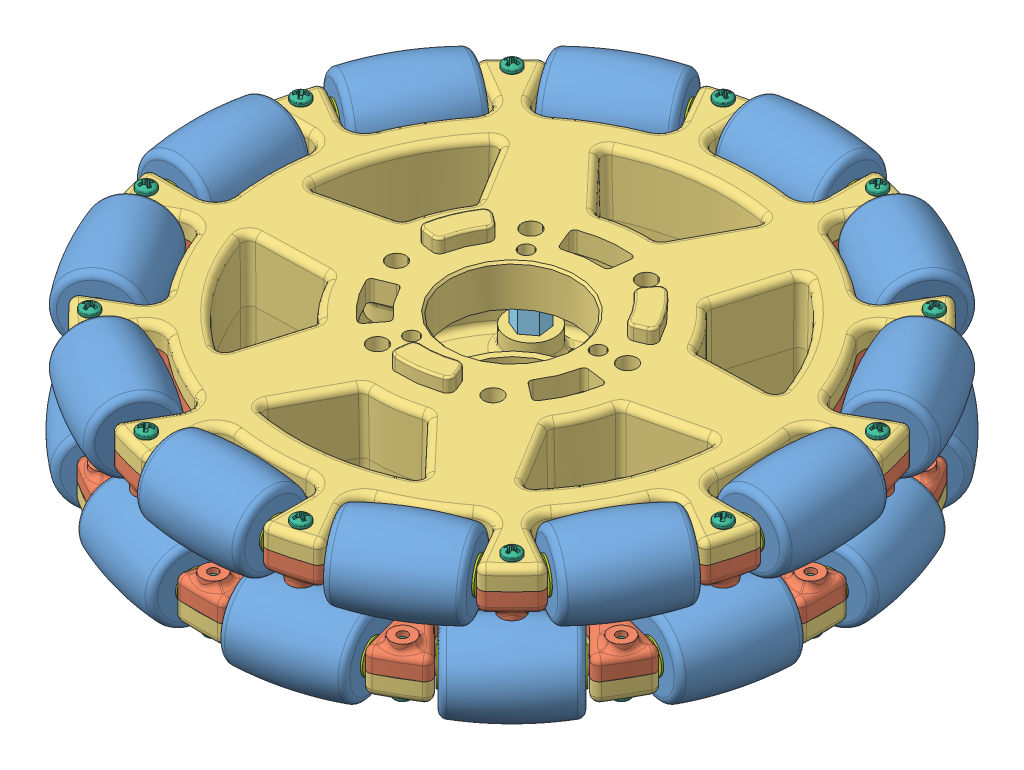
SolidWorks assembly 2_6 inch omni wheel.SLDASM, configuration Default (file format 7000). Lengths in mm.
Overall size (174.23 42.44 174.23).
129 component instances, 7 part files, 0 mates.
Components (placement in the parent):
- 2_217-2585-001 Rev1-1: 2_217-2585-001 Rev1.sldprt [Default] at (0 9.4629 -66.8297) x (1 0 0) z (0 -0.857126 0.515108) size (24.13 18.81 18.81)
- 2_217-2585-002 Rev1-1: 2_217-2585-002 Rev1.sldprt [Default] x (1 0 0) z (0 1 0) size (145.16 145.16 19.05)
- 2_217-2585-001 Rev1-2: 2_217-2585-001 Rev1.sldprt [Default] at (47.2557 -9.4629 47.2557) x (-0.707107 0 0.707107) z (-0.700403 -0.137373 -0.700403) size (24.13 18.81 18.81)
- 2_217-2585-001 Rev1-3: 2_217-2585-001 Rev1.sldprt [Default] at (17.2968 -9.4629 64.5525) x (-0.965926 0 0.258819) z (-0.256365 -0.137373 -0.956768) size (24.13 18.81 18.81)
- 2_217-2585-001 Rev1-4: 2_217-2585-001 Rev1.sldprt [Default] at (-17.2968 -9.4629 64.5525) x (-0.965926 0 -0.258819) z (0.256365 -0.137373 -0.956768) size (24.13 18.81 18.81)
- 2_217-2585-001 Rev1-5: 2_217-2585-001 Rev1.sldprt [Default] at (-47.2557 -9.4629 47.2557) x (-0.707107 0 -0.707107) z (0.700403 -0.137373 -0.700403) size (24.13 18.81 18.81)
- 2_217-2585-001 Rev1-6: 2_217-2585-001 Rev1.sldprt [Default] at (-64.5525 -9.4629 17.2968) x (-0.258819 0 -0.965926) z (0.956768 -0.137373 -0.256365) size (24.13 18.81 18.81)
- 2_217-2585-001 Rev1-7: 2_217-2585-001 Rev1.sldprt [Default] at (-64.5525 -9.4629 -17.2968) x (0.258819 0 -0.965926) z (0.956768 -0.137373 0.256365) size (24.13 18.81 18.81)
- 2_217-2585-001 Rev1-8: 2_217-2585-001 Rev1.sldprt [Default] at (-47.2557 -9.4629 -47.2557) x (0.707107 0 -0.707107) z (0.700403 -0.137373 0.700403) size (24.13 18.81 18.81)
- 2_217-2585-001 Rev1-9: 2_217-2585-001 Rev1.sldprt [Default] at (-17.2968 -9.4629 -64.5525) x (0.965926 0 -0.258819) z (0.256365 -0.137373 0.956768) size (24.13 18.81 18.81)
- 2_217-2585-001 Rev1-10: 2_217-2585-001 Rev1.sldprt [Default] at (17.2968 -9.4629 -64.5525) x (0.965926 0 0.258819) z (-0.256365 -0.137373 0.956768) size (24.13 18.81 18.81)
- 2_217-2585-001 Rev1-11: 2_217-2585-001 Rev1.sldprt [Default] at (47.2557 -9.4629 -47.2557) x (0.707107 0 0.707107) z (-0.700403 -0.137373 0.700403) size (24.13 18.81 18.81)
- 2_217-2585-001 Rev1-12: 2_217-2585-001 Rev1.sldprt [Default] at (64.5525 -9.4629 -17.2968) x (0.258819 0 0.965926) z (-0.956768 -0.137373 0.256365) size (24.13 18.81 18.81)
- 2_217-2585-001 Rev1-13: 2_217-2585-001 Rev1.sldprt [Default] at (64.5525 -9.4629 17.2968) x (-0.258819 0 0.965926) z (-0.956768 -0.137373 -0.256365) size (24.13 18.81 18.81)
- 2_217-2585-003 Rev2-1: 2_217-2585-003 Rev2.sldprt [Default] at (0 -9.525 0) x (0.965926 0 -0.258819) z (0 -1 0) size (142.26 142.26 17.6)
- 2_217-2585-004 Rev1-1: 2_217-2585-004 Rev1.sldprt [Default] at (-57.9397 9.4629 -33.3049) x (0.5 0 -0.866025) z (-0.558431 0.764334 -0.32241) size (30.16 3 3)
- 2_217-2585-004 Rev1-2: 2_217-2585-004 Rev1.sldprt [Default] at (-64.5197 -9.4629 -17.4195) x (0.258819 0 -0.965926) z (-0.83871 -0.496046 -0.224732) size (30.16 3 3)
- 2_217-2585-003 Rev2-2: 2_217-2585-003 Rev2.sldprt [Default] at (0 9.525 0) x (-1 0 0) z (0 1 0) size (142.26 142.26 17.6)
- 2_217-2585-004 Rev1-3: 2_217-2585-004 Rev1.sldprt [Default] at (-33.5248 9.4629 -57.8127) x (0.866025 0 -0.5) z (-0.32241 0.764334 -0.558431) size (30.16 3 3)
- 2_217-2585-004 Rev1-4: 2_217-2585-004 Rev1.sldprt [Default] at (-0.127 9.4629 -66.8297) x (1 0 0) z (0 0.764334 -0.644821) size (30.16 3 3)
- 2_217-2585-004 Rev1-5: 2_217-2585-004 Rev1.sldprt [Default] at (33.3049 9.4629 -57.9397) x (0.866025 0 0.5) z (0.32241 0.764334 -0.558431) size (30.16 3 3)
- 2_217-2585-004 Rev1-6: 2_217-2585-004 Rev1.sldprt [Default] at (57.8127 9.4629 -33.5248) x (0.5 0 0.866025) z (0.558431 0.764334 -0.32241) size (30.16 3 3)
- 2_217-2585-004 Rev1-7: 2_217-2585-004 Rev1.sldprt [Default] at (66.8297 9.4629 -0.127) x (0 0 1) z (0.644821 0.764334 0) size (30.16 3 3)
- 2_217-2585-004 Rev1-8: 2_217-2585-004 Rev1.sldprt [Default] at (57.9397 9.4629 33.3049) x (-0.5 0 0.866025) z (0.558431 0.764334 0.32241) size (30.16 3 3)
- 2_217-2585-004 Rev1-9: 2_217-2585-004 Rev1.sldprt [Default] at (33.5248 9.4629 57.8127) x (-0.866025 0 0.5) z (0.32241 0.764334 0.558431) size (30.16 3 3)
- 2_217-2585-004 Rev1-10: 2_217-2585-004 Rev1.sldprt [Default] at (0.127 9.4629 66.8297) x (-1 0 0) z (0 0.764334 0.644821) size (30.16 3 3)
- 2_217-2585-004 Rev1-11: 2_217-2585-004 Rev1.sldprt [Default] at (-33.3049 9.4629 57.9397) x (-0.866025 0 -0.5) z (-0.32241 0.764334 0.558431) size (30.16 3 3)
- 2_217-2585-004 Rev1-12: 2_217-2585-004 Rev1.sldprt [Default] at (-57.8127 9.4629 33.5248) x (-0.5 0 -0.866025) z (-0.558431 0.764334 0.32241) size (30.16 3 3)
- 2_217-2585-004 Rev1-13: 2_217-2585-004 Rev1.sldprt [Default] at (-66.8297 9.4629 0.127) x (0 0 -1) z (-0.644821 0.764334 0) size (30.16 3 3)
- 2_217-2585-004 Rev1-14: 2_217-2585-004 Rev1.sldprt [Default] at (-47.1659 -9.4629 -47.3455) x (0.707107 0 -0.707107) z (-0.613978 -0.496046 -0.613978) size (30.16 3 3)
- 2_217-2585-004 Rev1-15: 2_217-2585-004 Rev1.sldprt [Default] at (-17.1741 -9.4629 -64.5854) x (0.965926 0 -0.258819) z (-0.224732 -0.496046 -0.83871) size (30.16 3 3)
- 2_217-2585-004 Rev1-16: 2_217-2585-004 Rev1.sldprt [Default] at (17.4195 -9.4629 -64.5197) x (0.965926 0 0.258819) z (0.224732 -0.496046 -0.83871) size (30.16 3 3)
- 2_217-2585-004 Rev1-17: 2_217-2585-004 Rev1.sldprt [Default] at (47.3455 -9.4629 -47.1659) x (0.707107 0 0.707107) z (0.613978 -0.496046 -0.613978) size (30.16 3 3)
- 2_217-2585-004 Rev1-18: 2_217-2585-004 Rev1.sldprt [Default] at (64.5854 -9.4629 -17.1741) x (0.258819 0 0.965926) z (0.83871 -0.496046 -0.224732) size (30.16 3 3)
- 2_217-2585-004 Rev1-19: 2_217-2585-004 Rev1.sldprt [Default] at (64.5197 -9.4629 17.4195) x (-0.258819 0 0.965926) z (0.83871 -0.496046 0.224732) size (30.16 3 3)
- 2_217-2585-004 Rev1-20: 2_217-2585-004 Rev1.sldprt [Default] at (47.1659 -9.4629 47.3455) x (-0.707107 0 0.707107) z (0.613978 -0.496046 0.613978) size (30.16 3 3)
- 2_217-2585-004 Rev1-21: 2_217-2585-004 Rev1.sldprt [Default] at (17.1741 -9.4629 64.5854) x (-0.965926 0 0.258819) z (0.224732 -0.496046 0.83871) size (30.16 3 3)
- 2_217-2585-004 Rev1-22: 2_217-2585-004 Rev1.sldprt [Default] at (-17.4195 -9.4629 64.5197) x (-0.965926 0 -0.258819) z (-0.224732 -0.496046 0.83871) size (30.16 3 3)
- 2_217-2585-004 Rev1-23: 2_217-2585-004 Rev1.sldprt [Default] at (-47.3455 -9.4629 47.1659) x (-0.707107 0 -0.707107) z (-0.613978 -0.496046 0.613978) size (30.16 3 3)
- 2_217-2585-004 Rev1-24: 2_217-2585-004 Rev1.sldprt [Default] at (-64.5854 -9.4629 17.1741) x (-0.258819 0 -0.965926) z (-0.83871 -0.496046 0.224732) size (30.16 3 3)
- 2_217-2585-001 Rev1-14: 2_217-2585-001 Rev1.sldprt [Default] at (33.4148 9.4629 -57.8762) x (0.866025 0 0.5) z (-0.257554 -0.857126 0.446096) size (24.13 18.81 18.81)
- 2_217-2585-001 Rev1-15: 2_217-2585-001 Rev1.sldprt [Default] at (57.8762 9.4629 -33.4148) x (0.5 0 0.866025) z (-0.446096 -0.857126 0.257554) size (24.13 18.81 18.81)
- 2_217-2585-001 Rev1-16: 2_217-2585-001 Rev1.sldprt [Default] at (66.8297 9.4629 0) x (0 0 1) z (-0.515108 -0.857126 0) size (24.13 18.81 18.81)
- 2_217-2585-001 Rev1-17: 2_217-2585-001 Rev1.sldprt [Default] at (57.8762 9.4629 33.4148) x (-0.5 0 0.866025) z (-0.446096 -0.857126 -0.257554) size (24.13 18.81 18.81)
- 2_217-2585-001 Rev1-18: 2_217-2585-001 Rev1.sldprt [Default] at (33.4148 9.4629 57.8762) x (-0.866025 0 0.5) z (-0.257554 -0.857126 -0.446096) size (24.13 18.81 18.81)
- 2_217-2585-001 Rev1-19: 2_217-2585-001 Rev1.sldprt [Default] at (0 9.4629 66.8297) x (-1 0 0) z (0 -0.857126 -0.515108) size (24.13 18.81 18.81)
- 2_217-2585-001 Rev1-20: 2_217-2585-001 Rev1.sldprt [Default] at (-33.4148 9.4629 57.8762) x (-0.866025 0 -0.5) z (0.257554 -0.857126 -0.446096) size (24.13 18.81 18.81)
- 2_217-2585-001 Rev1-21: 2_217-2585-001 Rev1.sldprt [Default] at (-57.8762 9.4629 33.4148) x (-0.5 0 -0.866025) z (0.446096 -0.857126 -0.257554) size (24.13 18.81 18.81)
- 2_217-2585-001 Rev1-22: 2_217-2585-001 Rev1.sldprt [Default] at (-66.8297 9.4629 0) x (0 0 -1) z (0.515108 -0.857126 0) size (24.13 18.81 18.81)
- 2_217-2585-001 Rev1-23: 2_217-2585-001 Rev1.sldprt [Default] at (-57.8762 9.4629 -33.4148) x (0.5 0 -0.866025) z (0.446096 -0.857126 0.257554) size (24.13 18.81 18.81)
- 2_217-2585-001 Rev1-24: 2_217-2585-001 Rev1.sldprt [Default] at (-33.4148 9.4629 -57.8762) x (0.866025 0 -0.5) z (0.257554 -0.857126 0.446096) size (24.13 18.81 18.81)
- 2_BEAM-0750-1: 2_BEAM-0750.sldprt [Default] at (-23.6088 0 3.1082) x (0.793353 0 -0.608761) z (0.608761 0 0.793353) size (7.33 19.93 6.35)
- 2_BEAM-0750-2: 2_BEAM-0750.sldprt [Default] at (-14.4961 0 -18.8917) x (0.92388 0 0.382683) z (-0.382683 0 0.92388) size (7.33 19.93 6.35)
- 2_BEAM-0750-3: 2_BEAM-0750.sldprt [Default] at (9.1126 0 -21.9999) x (0.130526 0 0.991445) z (-0.991445 0 0.130526) size (7.33 19.93 6.35)
- 2_BEAM-0750-4: 2_BEAM-0750.sldprt [Default] at (23.6088 0 -3.1082) x (-0.793353 0 0.608761) z (-0.608761 0 -0.793353) size (7.33 19.93 6.35)
- 2_BEAM-0750-5: 2_BEAM-0750.sldprt [Default] at (14.4961 0 18.8917) x (-0.92388 0 -0.382683) z (0.382683 0 -0.92388) size (7.33 19.93 6.35)
- 2_BEAM-0750-6: 2_BEAM-0750.sldprt [Default] at (-9.1126 0 21.9999) x (-0.130526 0 -0.991445) z (0.991445 0 -0.130526) size (7.33 19.93 6.35)
- 2_90116A020_90116A020-1: 2_90116A020_90116A020.sldprt [Default] at (34.544 -4.2875 -59.832) x (0.956072 0 -0.293131) z (0 -1 0) size (4 4 11.7)
- 2_90116A020_90116A020-2: 2_90116A020_90116A020.sldprt [Default] at (59.832 -4.2875 -34.544) x (0.974548 0 0.224177) z (0 -1 0) size (4 4 11.7)
- 2_90116A020_90116A020-3: 2_90116A020_90116A020.sldprt [Default] at (69.088 -4.2875 0) x (0.731895 0 0.681417) z (0 -1 0) size (4 4 11.7)
- 2_90116A020_90116A020-4: 2_90116A020_90116A020.sldprt [Default] at (59.832 -4.2875 34.544) x (0.293131 0 0.956072) z (0 -1 0) size (4 4 11.7)
- 2_90116A020_90116A020-5: 2_90116A020_90116A020.sldprt [Default] at (34.544 -4.2875 59.832) x (-0.224177 0 0.974548) z (0 -1 0) size (4 4 11.7)
- 2_90116A020_90116A020-6: 2_90116A020_90116A020.sldprt [Default] at (0 -4.2875 69.088) x (-0.681417 0 0.731895) z (0 -1 0) size (4 4 11.7)
- 2_90116A020_90116A020-7: 2_90116A020_90116A020.sldprt [Default] at (-34.544 -4.2875 59.832) x (-0.956072 0 0.293131) z (0 -1 0) size (4 4 11.7)
- 2_90116A020_90116A020-8: 2_90116A020_90116A020.sldprt [Default] at (-59.832 -4.2875 34.544) x (-0.974548 0 -0.224177) z (0 -1 0) size (4 4 11.7)
- 2_90116A020_90116A020-9: 2_90116A020_90116A020.sldprt [Default] at (-69.088 -4.2875 0) x (-0.731895 0 -0.681417) z (0 -1 0) size (4 4 11.7)
- 2_90116A020_90116A020-10: 2_90116A020_90116A020.sldprt [Default] at (-59.832 -4.2875 -34.544) x (-0.293131 0 -0.956072) z (0 -1 0) size (4 4 11.7)
- 2_90116A020_90116A020-11: 2_90116A020_90116A020.sldprt [Default] at (-34.544 -4.2875 -59.832) x (0.224177 0 -0.974548) z (0 -1 0) size (4 4 11.7)
- 2_90116A020_90116A020-12: 2_90116A020_90116A020.sldprt [Default] at (0 -4.2875 -69.088) x (0.681417 0 -0.731895) z (0 -1 0) size (4 4 11.7)
- 2_90116A020_90116A020-13: 2_90116A020_90116A020.sldprt [Default] at (66.7339 4.2875 -17.8813) x (-0.938474 0 -0.34535) z (0 1 0) size (4 4 11.7)
- 2_90116A020_90116A020-14: 2_90116A020_90116A020.sldprt [Default] at (66.7339 4.2875 17.8813) x (-0.640068 0 -0.768319) z (0 1 0) size (4 4 11.7)
- 2_90116A020_90116A020-15: 2_90116A020_90116A020.sldprt [Default] at (48.8526 4.2875 48.8526) x (-0.170155 0 -0.985417) z (0 1 0) size (4 4 11.7)
- 2_90116A020_90116A020-16: 2_90116A020_90116A020.sldprt [Default] at (17.8813 4.2875 66.7339) x (0.34535 0 -0.938474) z (0 1 0) size (4 4 11.7)
- 2_90116A020_90116A020-17: 2_90116A020_90116A020.sldprt [Default] at (-17.8813 4.2875 66.7339) x (0.768319 0 -0.640068) z (0 1 0) size (4 4 11.7)
- 2_90116A020_90116A020-18: 2_90116A020_90116A020.sldprt [Default] at (-48.8526 4.2875 48.8526) x (0.985417 0 -0.170155) z (0 1 0) size (4 4 11.7)
- 2_90116A020_90116A020-19: 2_90116A020_90116A020.sldprt [Default] at (-66.7339 4.2875 17.8813) x (0.938474 0 0.34535) z (0 1 0) size (4 4 11.7)
- 2_90116A020_90116A020-20: 2_90116A020_90116A020.sldprt [Default] at (-66.7339 4.2875 -17.8813) x (0.640068 0 0.768319) z (0 1 0) size (4 4 11.7)
- 2_90116A020_90116A020-21: 2_90116A020_90116A020.sldprt [Default] at (-48.8526 4.2875 -48.8526) x (0.170155 0 0.985417) z (0 1 0) size (4 4 11.7)
- 2_90116A020_90116A020-22: 2_90116A020_90116A020.sldprt [Default] at (-17.8813 4.2875 -66.7339) x (-0.34535 0 0.938474) z (0 1 0) size (4 4 11.7)
- 2_90116A020_90116A020-23: 2_90116A020_90116A020.sldprt [Default] at (17.8813 4.2875 -66.7339) x (-0.768319 0 0.640068) z (0 1 0) size (4 4 11.7)
- 2_90116A020_90116A020-24: 2_90116A020_90116A020.sldprt [Default] at (48.8526 4.2875 -48.8526) x (-0.985417 0 0.170155) z (0 1 0) size (4 4 11.7)
- 2_217-2584-005 Rev1 A-1: 2_217-2584-005 Rev1 A.sldprt [Default] at (-7.3025 9.4629 -66.8297) x (0 -0.523633 0.851944) z (-1 0 0) size (7.38 7.38 9.92)
- 2_217-2584-005 Rev1 A-2: 2_217-2584-005 Rev1 A.sldprt [Default] at (7.3025 9.4629 -66.8297) x (0 -0.987336 0.15864) z (1 0 0) size (7.38 7.38 9.92)
- 2_217-2584-005 Rev1 A-3: 2_217-2584-005 Rev1 A.sldprt [Default] at (-24.3505 -9.4629 -62.6625) x (-0.242217 -0.352388 -0.903966) z (-0.965926 0 0.258819) size (7.38 7.38 9.92)
- 2_217-2584-005 Rev1 A-4: 2_217-2584-005 Rev1 A.sldprt [Default] at (-10.2431 -9.4629 -66.4425) x (0.244105 0.332373 0.911011) z (0.965926 0 -0.258819) size (7.38 7.38 9.92)
- 2_217-2584-005 Rev1 A-5: 2_217-2584-005 Rev1 A.sldprt [Default] at (10.2431 -9.4629 -66.4425) x (0.242217 -0.352388 -0.903966) z (-0.965926 0 -0.258819) size (7.38 7.38 9.92)
- 2_217-2584-005 Rev1 A-6: 2_217-2584-005 Rev1 A.sldprt [Default] at (42.0921 -9.4629 -52.4194) x (0.661749 -0.352388 -0.661749) z (-0.707107 0 -0.707107) size (7.38 7.38 9.92)
- 2_217-2584-005 Rev1 A-7: 2_217-2584-005 Rev1 A.sldprt [Default] at (62.6625 -9.4629 -24.3505) x (0.903966 -0.352388 -0.242217) z (-0.258819 0 -0.965926) size (7.38 7.38 9.92)
- 2_217-2584-005 Rev1 A-8: 2_217-2584-005 Rev1 A.sldprt [Default] at (66.4425 -9.4629 10.2431) x (0.903966 -0.352388 0.242217) z (0.258819 0 -0.965926) size (7.38 7.38 9.92)
- 2_217-2584-005 Rev1 A-9: 2_217-2584-005 Rev1 A.sldprt [Default] at (52.4194 -9.4629 42.0921) x (0.661749 -0.352388 0.661749) z (0.707107 0 -0.707107) size (7.38 7.38 9.92)
- 2_217-2584-005 Rev1 A-10: 2_217-2584-005 Rev1 A.sldprt [Default] at (24.3505 -9.4629 62.6625) x (0.242217 -0.352388 0.903966) z (0.965926 0 -0.258819) size (7.38 7.38 9.92)
- 2_217-2584-005 Rev1 A-11: 2_217-2584-005 Rev1 A.sldprt [Default] at (-10.2431 -9.4629 66.4425) x (-0.242217 -0.352388 0.903966) z (0.965926 0 0.258819) size (7.38 7.38 9.92)
- 2_217-2584-005 Rev1 A-12: 2_217-2584-005 Rev1 A.sldprt [Default] at (-42.0921 -9.4629 52.4194) x (-0.661749 -0.352388 0.661749) z (0.707107 0 0.707107) size (7.38 7.38 9.92)
- 2_217-2584-005 Rev1 A-13: 2_217-2584-005 Rev1 A.sldprt [Default] at (-62.6625 -9.4629 24.3505) x (-0.903966 -0.352388 0.242217) z (0.258819 0 0.965926) size (7.38 7.38 9.92)
- 2_217-2584-005 Rev1 A-14: 2_217-2584-005 Rev1 A.sldprt [Default] at (-66.4425 -9.4629 -10.2431) x (-0.903966 -0.352388 -0.242217) z (-0.258819 0 0.965926) size (7.38 7.38 9.92)
- 2_217-2584-005 Rev1 A-15: 2_217-2584-005 Rev1 A.sldprt [Default] at (-52.4194 -9.4629 -42.0921) x (-0.661749 -0.352388 -0.661749) z (-0.707107 0 0.707107) size (7.38 7.38 9.92)
- 2_217-2584-005 Rev1 A-16: 2_217-2584-005 Rev1 A.sldprt [Default] at (24.3505 -9.4629 -62.6625) x (-0.244105 0.332373 0.911011) z (0.965926 0 0.258819) size (7.38 7.38 9.92)
- 2_217-2584-005 Rev1 A-17: 2_217-2584-005 Rev1 A.sldprt [Default] at (52.4194 -9.4629 -42.0921) x (-0.666906 0.332373 0.666906) z (0.707107 0 0.707107) size (7.38 7.38 9.92)
- 2_217-2584-005 Rev1 A-18: 2_217-2584-005 Rev1 A.sldprt [Default] at (66.4425 -9.4629 -10.2431) x (-0.911011 0.332373 0.244105) z (0.258819 0 0.965926) size (7.38 7.38 9.92)
- 2_217-2584-005 Rev1 A-19: 2_217-2584-005 Rev1 A.sldprt [Default] at (62.6625 -9.4629 24.3505) x (-0.911011 0.332373 -0.244105) z (-0.258819 0 0.965926) size (7.38 7.38 9.92)
- 2_217-2584-005 Rev1 A-20: 2_217-2584-005 Rev1 A.sldprt [Default] at (42.0921 -9.4629 52.4194) x (-0.666906 0.332373 -0.666906) z (-0.707107 0 0.707107) size (7.38 7.38 9.92)
- 2_217-2584-005 Rev1 A-21: 2_217-2584-005 Rev1 A.sldprt [Default] at (10.2431 -9.4629 66.4425) x (-0.244105 0.332373 -0.911011) z (-0.965926 0 0.258819) size (7.38 7.38 9.92)
- 2_217-2584-005 Rev1 A-22: 2_217-2584-005 Rev1 A.sldprt [Default] at (-24.3505 -9.4629 62.6625) x (0.244105 0.332373 -0.911011) z (-0.965926 0 -0.258819) size (7.38 7.38 9.92)
- 2_217-2584-005 Rev1 A-23: 2_217-2584-005 Rev1 A.sldprt [Default] at (-52.4194 -9.4629 42.0921) x (0.666906 0.332373 -0.666906) z (-0.707107 0 -0.707107) size (7.38 7.38 9.92)
- 2_217-2584-005 Rev1 A-24: 2_217-2584-005 Rev1 A.sldprt [Default] at (-66.4425 -9.4629 10.2431) x (0.911011 0.332373 -0.244105) z (-0.258819 0 -0.965926) size (7.38 7.38 9.92)
- 2_217-2584-005 Rev1 A-25: 2_217-2584-005 Rev1 A.sldprt [Default] at (-62.6625 -9.4629 -24.3505) x (0.911011 0.332373 0.244105) z (0.258819 0 -0.965926) size (7.38 7.38 9.92)
- 2_217-2584-005 Rev1 A-26: 2_217-2584-005 Rev1 A.sldprt [Default] at (-42.0921 -9.4629 -52.4194) x (0.666906 0.332373 0.666906) z (0.707107 0 -0.707107) size (7.38 7.38 9.92)
- 2_217-2584-005 Rev1 A-27: 2_217-2584-005 Rev1 A.sldprt [Default] at (39.739 9.4629 -54.225) x (-0.07932 -0.987336 0.137386) z (0.866025 0 0.5) size (7.38 7.38 9.92)
- 2_217-2584-005 Rev1 A-28: 2_217-2584-005 Rev1 A.sldprt [Default] at (61.5275 9.4629 -27.0907) x (-0.137386 -0.987336 0.07932) z (0.5 0 0.866025) size (7.38 7.38 9.92)
- 2_217-2584-005 Rev1 A-29: 2_217-2584-005 Rev1 A.sldprt [Default] at (66.8297 9.4629 7.3025) x (-0.15864 -0.987336 0) z (0 0 1) size (7.38 7.38 9.92)
- 2_217-2584-005 Rev1 A-30: 2_217-2584-005 Rev1 A.sldprt [Default] at (54.225 9.4629 39.739) x (-0.137386 -0.987336 -0.07932) z (-0.5 0 0.866025) size (7.38 7.38 9.92)
- 2_217-2584-005 Rev1 A-31: 2_217-2584-005 Rev1 A.sldprt [Default] at (27.0907 9.4629 61.5275) x (-0.07932 -0.987336 -0.137386) z (-0.866025 0 0.5) size (7.38 7.38 9.92)
- 2_217-2584-005 Rev1 A-32: 2_217-2584-005 Rev1 A.sldprt [Default] at (-7.3025 9.4629 66.8297) x (0 -0.987336 -0.15864) z (-1 0 0) size (7.38 7.38 9.92)
- 2_217-2584-005 Rev1 A-33: 2_217-2584-005 Rev1 A.sldprt [Default] at (-39.739 9.4629 54.225) x (0.07932 -0.987336 -0.137386) z (-0.866025 0 -0.5) size (7.38 7.38 9.92)
- 2_217-2584-005 Rev1 A-34: 2_217-2584-005 Rev1 A.sldprt [Default] at (-61.5275 9.4629 27.0907) x (0.137386 -0.987336 -0.07932) z (-0.5 0 -0.866025) size (7.38 7.38 9.92)
- 2_217-2584-005 Rev1 A-35: 2_217-2584-005 Rev1 A.sldprt [Default] at (-66.8297 9.4629 -7.3025) x (0.15864 -0.987336 0) z (0 0 -1) size (7.38 7.38 9.92)
- 2_217-2584-005 Rev1 A-36: 2_217-2584-005 Rev1 A.sldprt [Default] at (-54.225 9.4629 -39.739) x (0.137386 -0.987336 0.07932) z (0.5 0 -0.866025) size (7.38 7.38 9.92)
- 2_217-2584-005 Rev1 A-37: 2_217-2584-005 Rev1 A.sldprt [Default] at (-27.0907 9.4629 -61.5275) x (0.07932 -0.987336 0.137386) z (0.866025 0 -0.5) size (7.38 7.38 9.92)
- 2_217-2584-005 Rev1 A-38: 2_217-2584-005 Rev1 A.sldprt [Default] at (27.0907 9.4629 -61.5275) x (-0.425972 -0.523633 0.737805) z (-0.866025 0 -0.5) size (7.38 7.38 9.92)
- 2_217-2584-005 Rev1 A-39: 2_217-2584-005 Rev1 A.sldprt [Default] at (54.225 9.4629 -39.739) x (-0.737805 -0.523633 0.425972) z (-0.5 0 -0.866025) size (7.38 7.38 9.92)
- 2_217-2584-005 Rev1 A-40: 2_217-2584-005 Rev1 A.sldprt [Default] at (66.8297 9.4629 -7.3025) x (-0.851944 -0.523633 0) z (0 0 -1) size (7.38 7.38 9.92)
- 2_217-2584-005 Rev1 A-41: 2_217-2584-005 Rev1 A.sldprt [Default] at (61.5275 9.4629 27.0907) x (-0.737805 -0.523633 -0.425972) z (0.5 0 -0.866025) size (7.38 7.38 9.92)
- 2_217-2584-005 Rev1 A-42: 2_217-2584-005 Rev1 A.sldprt [Default] at (39.739 9.4629 54.225) x (-0.425972 -0.523633 -0.737805) z (0.866025 0 -0.5) size (7.38 7.38 9.92)
- 2_217-2584-005 Rev1 A-43: 2_217-2584-005 Rev1 A.sldprt [Default] at (7.3025 9.4629 66.8297) x (0 -0.523633 -0.851944) z (1 0 0) size (7.38 7.38 9.92)
- 2_217-2584-005 Rev1 A-44: 2_217-2584-005 Rev1 A.sldprt [Default] at (-27.0907 9.4629 61.5275) x (0.425972 -0.523633 -0.737805) z (0.866025 0 0.5) size (7.38 7.38 9.92)
- 2_217-2584-005 Rev1 A-45: 2_217-2584-005 Rev1 A.sldprt [Default] at (-54.225 9.4629 39.739) x (0.737805 -0.523633 -0.425972) z (0.5 0 0.866025) size (7.38 7.38 9.92)
- 2_217-2584-005 Rev1 A-46: 2_217-2584-005 Rev1 A.sldprt [Default] at (-66.8297 9.4629 7.3025) x (0.851944 -0.523633 0) z (0 0 1) size (7.38 7.38 9.92)
- 2_217-2584-005 Rev1 A-47: 2_217-2584-005 Rev1 A.sldprt [Default] at (-61.5275 9.4629 -27.0907) x (0.737805 -0.523633 0.425972) z (-0.5 0 0.866025) size (7.38 7.38 9.92)
- 2_217-2584-005 Rev1 A-48: 2_217-2584-005 Rev1 A.sldprt [Default] at (-39.739 9.4629 -54.225) x (0.425972 -0.523633 0.737805) z (-0.866025 0 0.5) size (7.38 7.38 9.92)
